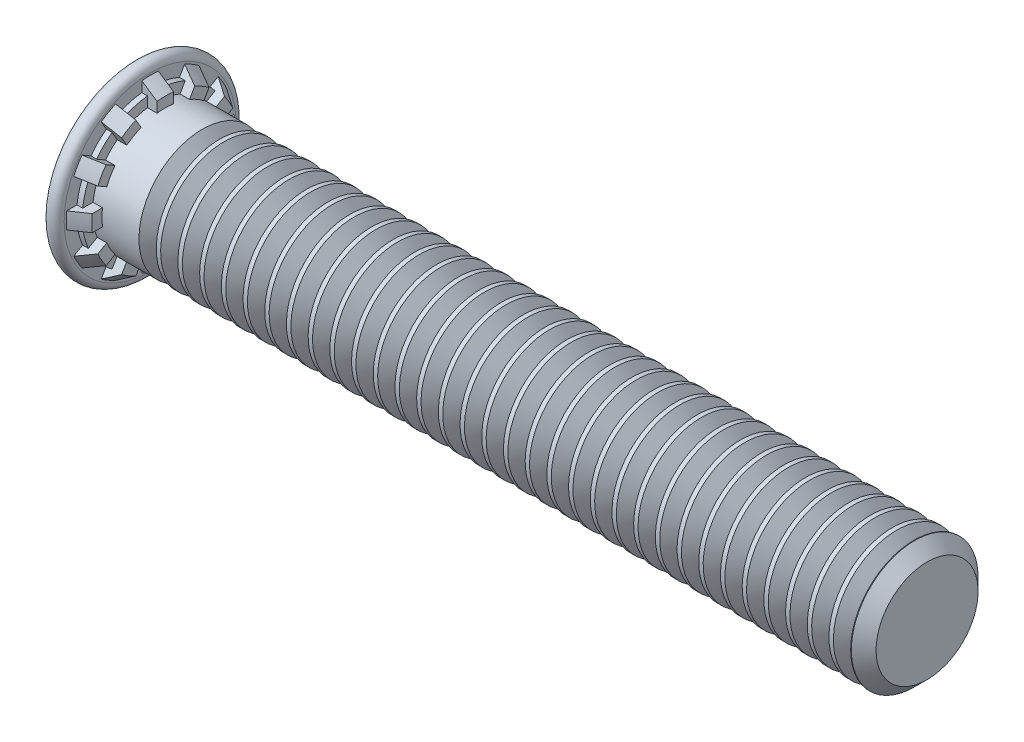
from build123d import *

# Parameters (mm, degrees)
THDSCHPAT_COUNT  = 33
THDSCHPAT_PITCH  = 0.684848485
RIBCUT1_DEPTH    = 0.3
RIBCUT2_DEPTH    = 0.48
RIBCUTSPAT_COUNT = 12
RIBCUTSPAT_ANGLE = 330


with BuildPart() as part:
    # BodySke → BaseBody (revolve)
    with BuildSketch(Plane.XY, mode=Mode.PRIVATE) as basebody_sk:
        with BuildLine():
            Line((0, 0), (0, 2.70746))
            Line((0, 2.70746), (0.00508, 2.70746))
            Line((0.00508, 2.70746), (0.00508, 2.71254))
            ThreePointArc((0.00508, 2.71254), (0.24254, 2.95), (0.48, 2.71254))
            Line((0.48, 2.71254), (0.48, 2.645))
            Line((0.48, 2.645), (0.96, 2.3225))
            Line((0.96, 2.3225), (0.96, 2))
            Line((0.96, 2), (24.61, 2))
            Line((24.61, 2), (25, 1.61))
            Line((25, 1.61), (25, 0))
            Line((25, 0), (0, 0))
        make_face()
    revolve(basebody_sk.sketch.rotate(Axis((0, 0, 0), (1, 0, 0)), 90), axis=Axis((0, 0, 0), (1, 0, 0)))

    # ThdSchSke → ThreadSchematic (revolve, cut)
    with BuildSketch(Plane.XY, mode=Mode.PRIVATE) as threadschematic_sk:
        Polygon((2.4, -1.61), (2.12691906, -2), (2.12691906, -2.5), (2.67308094, -2.5), (2.67308094, -2), align=None)
    threadschematic = revolve(threadschematic_sk.sketch.rotate(Axis((-3.175, 0, 0), (1, 0, 0)), 270), axis=Axis((-3.175, 0, 0), (1, 0, 0)), mode=Mode.SUBTRACT)

    # ThdSchPat: ThreadSchematic ×33
    with Locations(*[(i * THDSCHPAT_PITCH, 0, 0) for i in range(1, THDSCHPAT_COUNT)]):
        add(threadschematic, mode=Mode.SUBTRACT)

    # RibCut1Ske → RibCut1 (cut)
    with BuildSketch(Plane(origin=(0.96, 0, 0), x_dir=(0, 0, -1), z_dir=(1, 0, 0))):
        with BuildLine():
            Line((0.261052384, 1.982889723), (0.261052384, 2.938426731))
            ThreePointArc((0.261052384, 2.938426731), (0.763516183, 2.849481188), (1.243135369, 2.675278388))
            Line((1.243135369, 2.675278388), (0.765366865, 1.847759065))
            ThreePointArc((0.765366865, 1.847759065), (0.51763809, 1.931851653), (0.261052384, 1.982889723))
        make_face()
    ribcut1 = extrude(amount=-RIBCUT1_DEPTH, mode=Mode.SUBTRACT)

    # RibCut2Ske → RibCut2 (cut)
    with BuildSketch(Plane(origin=(0.96, 0, 0), x_dir=(0, 0, -1), z_dir=(1, 0, 0))):
        with BuildLine():
            Line((0.261052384, 2.307782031), (0.261052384, 2.938426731))
            ThreePointArc((0.261052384, 2.938426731), (0.763516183, 2.849481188), (1.243135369, 2.675278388))
            Line((1.243135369, 2.675278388), (0.927813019, 2.129124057))
            ThreePointArc((0.927813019, 2.129124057), (0.601107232, 2.243362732), (0.261052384, 2.307782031))
        make_face()
    ribcut2 = extrude(amount=-RIBCUT2_DEPTH, mode=Mode.SUBTRACT)

    # RibCutsPat: RibCut1, RibCut2 ×12 about axis
    ribcutspat_axis = Axis((0, 0, 0), (1, 0, 0))
    add([ribcut1.rotate(ribcutspat_axis, i * RIBCUTSPAT_ANGLE / (RIBCUTSPAT_COUNT - 1)) for i in range(1, RIBCUTSPAT_COUNT)], mode=Mode.SUBTRACT)
    add([ribcut2.rotate(ribcutspat_axis, i * RIBCUTSPAT_ANGLE / (RIBCUTSPAT_COUNT - 1)) for i in range(1, RIBCUTSPAT_COUNT)], mode=Mode.SUBTRACT)


solid = part.part
